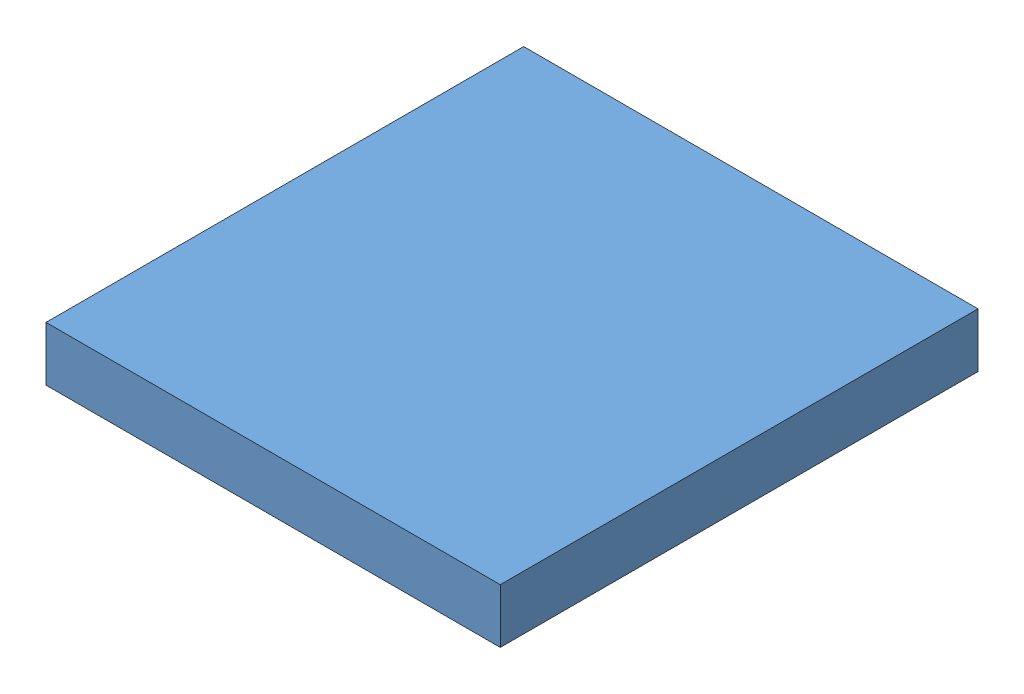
SolidWorks assembly Baugruppe2.SLDASM, configuration keines (file format 3100). Lengths in mm.
Overall size (100.26 12 105.44).
3 component instances, 3 part files, 2 mates.
Components (placement in the parent):
- Teil2-1: Teil2.SLDPRT [Standard] at origin size (100.26 12 105.44)
- Teil4-1: Teil4.SLDPRT [Standard] at (64.0539 12 -66.1669) size (57 34 57) (suppressed, hidden)
- Teil3-1: Teil3.SLDPRT [Standard] at (3.6957 12 -36.5217) size (30.19 50 30.52) (suppressed, hidden)
Mates (geometry in assembly coordinates):
- Deckungsgleich1: coincident anti-aligned: plane of Teil2-1 through (0 12 -105.436) normal (0 1 0); plane of Teil3-1 through (3.6957 12 -67.0398) normal (0 -1 0)
- Deckungsgleich2: coincident anti-aligned: plane of Teil2-1 through (0 12 -105.436) normal (0 1 0); plane of Teil4-1 through (64.0539 12 -66.1669) normal (0 -1 0)
